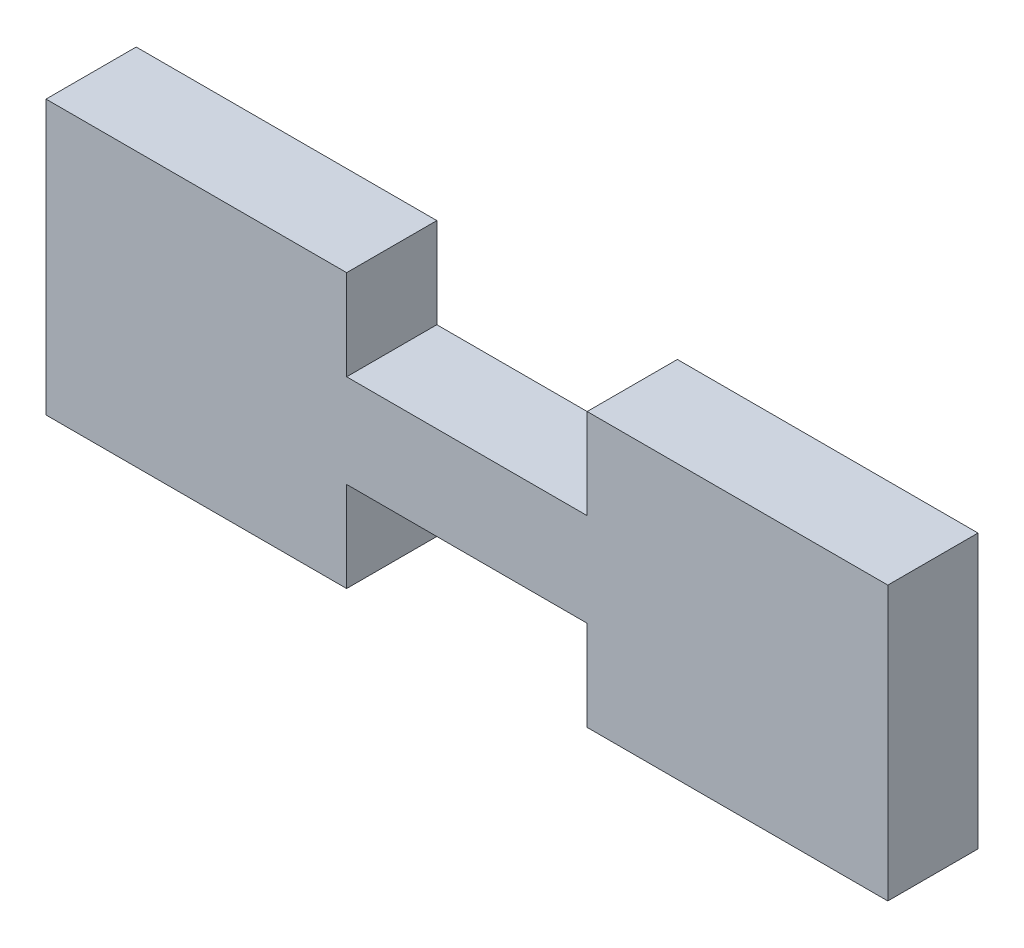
ISO-10303-21;
HEADER;
FILE_DESCRIPTION(('STEP AP214'),'2;1');
FILE_NAME('part.step','',(''),(''),'','','');
FILE_SCHEMA(('AUTOMOTIVE_DESIGN { 1 0 10303 214 1 1 1 1 }'));
ENDSEC;
DATA;
#1=APPLICATION_CONTEXT('core data for automotive mechanical design processes');
#2=APPLICATION_PROTOCOL_DEFINITION('international standard','automotive_design',2000,#1);
#3=PRODUCT_CONTEXT('',#1,'mechanical');
#4=PRODUCT('Part','Part','',(#3));
#5=PRODUCT_RELATED_PRODUCT_CATEGORY('part','',(#4));
#6=PRODUCT_DEFINITION_FORMATION('','',#4);
#7=PRODUCT_DEFINITION_CONTEXT('part definition',#1,'design');
#8=PRODUCT_DEFINITION('design','',#6,#7);
#9=PRODUCT_DEFINITION_SHAPE('','',#8);
#10=(LENGTH_UNIT() NAMED_UNIT(*) SI_UNIT(.MILLI.,.METRE.));
#11=(NAMED_UNIT(*) PLANE_ANGLE_UNIT() SI_UNIT($,.RADIAN.));
#12=(NAMED_UNIT(*) SI_UNIT($,.STERADIAN.) SOLID_ANGLE_UNIT());
#13=UNCERTAINTY_MEASURE_WITH_UNIT(LENGTH_MEASURE(1.E-05),#10,'distance_accuracy_value','');
#14=(GEOMETRIC_REPRESENTATION_CONTEXT(3) GLOBAL_UNCERTAINTY_ASSIGNED_CONTEXT((#13)) GLOBAL_UNIT_ASSIGNED_CONTEXT((#10,
#11,#12)) REPRESENTATION_CONTEXT('',''));
#15=CARTESIAN_POINT('',(0.,0.,0.));
#16=DIRECTION('',(0.,0.,1.));
#17=DIRECTION('',(1.,0.,0.));
#18=AXIS2_PLACEMENT_3D('',#15,#16,#17);
#19=CARTESIAN_POINT('',(22.3846510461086,-3.,3.));
#20=DIRECTION('',(0.,1.,0.));
#21=DIRECTION('',(0.,0.,1.));
#22=AXIS2_PLACEMENT_3D('',#19,#20,#21);
#23=PLANE('',#22);
#24=DIRECTION('',(1.,0.,0.));
#25=VECTOR('',#24,1.);
#26=CARTESIAN_POINT('',(22.3846510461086,-3.,0.));
#27=LINE('',#26,#25);
#28=CARTESIAN_POINT('',(12.3846510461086,-3.,0.));
#29=VERTEX_POINT('',#28);
#30=CARTESIAN_POINT('',(22.3846510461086,-3.,0.));
#31=VERTEX_POINT('',#30);
#32=EDGE_CURVE('E153',#29,#31,#27,.T.);
#33=ORIENTED_EDGE('',*,*,#32,.T.);
#34=DIRECTION('',(0.,0.,-1.));
#35=VECTOR('',#34,1.);
#36=CARTESIAN_POINT('',(22.3846510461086,-3.,3.));
#37=LINE('',#36,#35);
#38=CARTESIAN_POINT('',(22.3846510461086,-3.,3.));
#39=VERTEX_POINT('',#38);
#40=EDGE_CURVE('E11',#39,#31,#37,.T.);
#41=ORIENTED_EDGE('',*,*,#40,.F.);
#42=DIRECTION('',(1.,0.,0.));
#43=VECTOR('',#42,1.);
#44=CARTESIAN_POINT('',(22.3846510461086,-3.,3.));
#45=LINE('',#44,#43);
#46=CARTESIAN_POINT('',(12.3846510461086,-3.,3.));
#47=VERTEX_POINT('',#46);
#48=EDGE_CURVE('E175',#47,#39,#45,.T.);
#49=ORIENTED_EDGE('',*,*,#48,.F.);
#50=DIRECTION('',(0.,0.,-1.));
#51=VECTOR('',#50,1.);
#52=CARTESIAN_POINT('',(12.3846510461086,-3.,3.));
#53=LINE('',#52,#51);
#54=EDGE_CURVE('E149',#47,#29,#53,.T.);
#55=ORIENTED_EDGE('',*,*,#54,.T.);
#56=EDGE_LOOP('',(#33,#41,#49,#55));
#57=FACE_BOUND('',#56,.T.);
#58=ADVANCED_FACE('F33',(#57),#23,.F.);
#59=CARTESIAN_POINT('',(22.3846510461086,0.,3.));
#60=DIRECTION('',(-1.,0.,0.));
#61=DIRECTION('',(0.,0.,1.));
#62=AXIS2_PLACEMENT_3D('',#59,#60,#61);
#63=PLANE('',#62);
#64=DIRECTION('',(0.,1.,0.));
#65=VECTOR('',#64,1.);
#66=CARTESIAN_POINT('',(22.3846510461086,0.,0.));
#67=LINE('',#66,#65);
#68=CARTESIAN_POINT('',(22.3846510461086,0.,0.));
#69=VERTEX_POINT('',#68);
#70=EDGE_CURVE('E156',#31,#69,#67,.T.);
#71=ORIENTED_EDGE('',*,*,#70,.T.);
#72=DIRECTION('',(0.,0.,-1.));
#73=VECTOR('',#72,1.);
#74=CARTESIAN_POINT('',(22.3846510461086,0.,3.));
#75=LINE('',#74,#73);
#76=CARTESIAN_POINT('',(22.3846510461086,0.,3.));
#77=VERTEX_POINT('',#76);
#78=EDGE_CURVE('E41',#77,#69,#75,.T.);
#79=ORIENTED_EDGE('',*,*,#78,.F.);
#80=DIRECTION('',(0.,1.,0.));
#81=VECTOR('',#80,1.);
#82=CARTESIAN_POINT('',(22.3846510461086,0.,3.));
#83=LINE('',#82,#81);
#84=EDGE_CURVE('E104',#39,#77,#83,.T.);
#85=ORIENTED_EDGE('',*,*,#84,.F.);
#86=ORIENTED_EDGE('',*,*,#40,.T.);
#87=EDGE_LOOP('',(#71,#79,#85,#86));
#88=FACE_BOUND('',#87,.T.);
#89=ADVANCED_FACE('F253',(#88),#63,.F.);
#90=CARTESIAN_POINT('',(30.3846510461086,0.,3.));
#91=DIRECTION('',(0.,1.,0.));
#92=DIRECTION('',(0.,0.,1.));
#93=AXIS2_PLACEMENT_3D('',#90,#91,#92);
#94=PLANE('',#93);
#95=DIRECTION('',(1.,0.,0.));
#96=VECTOR('',#95,1.);
#97=CARTESIAN_POINT('',(30.3846510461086,0.,0.));
#98=LINE('',#97,#96);
#99=CARTESIAN_POINT('',(30.3846510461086,0.,0.));
#100=VERTEX_POINT('',#99);
#101=EDGE_CURVE('E158',#69,#100,#98,.T.);
#102=ORIENTED_EDGE('',*,*,#101,.T.);
#103=DIRECTION('',(0.,0.,-1.));
#104=VECTOR('',#103,1.);
#105=CARTESIAN_POINT('',(30.3846510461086,0.,3.));
#106=LINE('',#105,#104);
#107=CARTESIAN_POINT('',(30.3846510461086,0.,3.));
#108=VERTEX_POINT('',#107);
#109=EDGE_CURVE('E194',#108,#100,#106,.T.);
#110=ORIENTED_EDGE('',*,*,#109,.F.);
#111=DIRECTION('',(1.,0.,0.));
#112=VECTOR('',#111,1.);
#113=CARTESIAN_POINT('',(30.3846510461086,0.,3.));
#114=LINE('',#113,#112);
#115=EDGE_CURVE('E202',#77,#108,#114,.T.);
#116=ORIENTED_EDGE('',*,*,#115,.F.);
#117=ORIENTED_EDGE('',*,*,#78,.T.);
#118=EDGE_LOOP('',(#102,#110,#116,#117));
#119=FACE_BOUND('',#118,.T.);
#120=ADVANCED_FACE('F200',(#119),#94,.F.);
#121=CARTESIAN_POINT('',(30.3846510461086,-3.,3.));
#122=DIRECTION('',(1.,0.,0.));
#123=DIRECTION('',(0.,0.,-1.));
#124=AXIS2_PLACEMENT_3D('',#121,#122,#123);
#125=PLANE('',#124);
#126=DIRECTION('',(0.,-1.,0.));
#127=VECTOR('',#126,1.);
#128=CARTESIAN_POINT('',(30.3846510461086,-3.,0.));
#129=LINE('',#128,#127);
#130=CARTESIAN_POINT('',(30.3846510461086,-3.,0.));
#131=VERTEX_POINT('',#130);
#132=EDGE_CURVE('E160',#100,#131,#129,.T.);
#133=ORIENTED_EDGE('',*,*,#132,.T.);
#134=DIRECTION('',(0.,0.,-1.));
#135=VECTOR('',#134,1.);
#136=CARTESIAN_POINT('',(30.3846510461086,-3.,3.));
#137=LINE('',#136,#135);
#138=CARTESIAN_POINT('',(30.3846510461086,-3.,3.));
#139=VERTEX_POINT('',#138);
#140=EDGE_CURVE('E191',#139,#131,#137,.T.);
#141=ORIENTED_EDGE('',*,*,#140,.F.);
#142=DIRECTION('',(0.,-1.,0.));
#143=VECTOR('',#142,1.);
#144=CARTESIAN_POINT('',(30.3846510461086,-3.,3.));
#145=LINE('',#144,#143);
#146=EDGE_CURVE('E220',#108,#139,#145,.T.);
#147=ORIENTED_EDGE('',*,*,#146,.F.);
#148=ORIENTED_EDGE('',*,*,#109,.T.);
#149=EDGE_LOOP('',(#133,#141,#147,#148));
#150=FACE_BOUND('',#149,.T.);
#151=ADVANCED_FACE('F211',(#150),#125,.F.);
#152=CARTESIAN_POINT('',(40.3846510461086,-3.,3.));
#153=DIRECTION('',(0.,1.,0.));
#154=DIRECTION('',(0.,0.,1.));
#155=AXIS2_PLACEMENT_3D('',#152,#153,#154);
#156=PLANE('',#155);
#157=DIRECTION('',(1.,0.,0.));
#158=VECTOR('',#157,1.);
#159=CARTESIAN_POINT('',(40.3846510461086,-3.,0.));
#160=LINE('',#159,#158);
#161=CARTESIAN_POINT('',(40.3846510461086,-3.,0.));
#162=VERTEX_POINT('',#161);
#163=EDGE_CURVE('E162',#131,#162,#160,.T.);
#164=ORIENTED_EDGE('',*,*,#163,.T.);
#165=DIRECTION('',(0.,0.,-1.));
#166=VECTOR('',#165,1.);
#167=CARTESIAN_POINT('',(40.3846510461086,-3.,3.));
#168=LINE('',#167,#166);
#169=CARTESIAN_POINT('',(40.3846510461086,-3.,3.));
#170=VERTEX_POINT('',#169);
#171=EDGE_CURVE('E188',#170,#162,#168,.T.);
#172=ORIENTED_EDGE('',*,*,#171,.F.);
#173=DIRECTION('',(1.,0.,0.));
#174=VECTOR('',#173,1.);
#175=CARTESIAN_POINT('',(40.3846510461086,-3.,3.));
#176=LINE('',#175,#174);
#177=EDGE_CURVE('E217',#139,#170,#176,.T.);
#178=ORIENTED_EDGE('',*,*,#177,.F.);
#179=ORIENTED_EDGE('',*,*,#140,.T.);
#180=EDGE_LOOP('',(#164,#172,#178,#179));
#181=FACE_BOUND('',#180,.T.);
#182=ADVANCED_FACE('F215',(#181),#156,.F.);
#183=CARTESIAN_POINT('',(40.3846510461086,6.09999999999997,3.));
#184=DIRECTION('',(-1.,0.,0.));
#185=DIRECTION('',(0.,-1.,0.));
#186=AXIS2_PLACEMENT_3D('',#183,#184,#185);
#187=PLANE('',#186);
#188=DIRECTION('',(0.,1.,0.));
#189=VECTOR('',#188,1.);
#190=CARTESIAN_POINT('',(40.3846510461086,6.09999999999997,0.));
#191=LINE('',#190,#189);
#192=CARTESIAN_POINT('',(40.3846510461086,6.09999999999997,0.));
#193=VERTEX_POINT('',#192);
#194=EDGE_CURVE('E164',#162,#193,#191,.T.);
#195=ORIENTED_EDGE('',*,*,#194,.T.);
#196=DIRECTION('',(0.,0.,-1.));
#197=VECTOR('',#196,1.);
#198=CARTESIAN_POINT('',(40.3846510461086,6.09999999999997,3.));
#199=LINE('',#198,#197);
#200=CARTESIAN_POINT('',(40.3846510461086,6.09999999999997,3.));
#201=VERTEX_POINT('',#200);
#202=EDGE_CURVE('E185',#201,#193,#199,.T.);
#203=ORIENTED_EDGE('',*,*,#202,.F.);
#204=DIRECTION('',(0.,1.,0.));
#205=VECTOR('',#204,1.);
#206=CARTESIAN_POINT('',(40.3846510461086,6.09999999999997,3.));
#207=LINE('',#206,#205);
#208=EDGE_CURVE('E219',#170,#201,#207,.T.);
#209=ORIENTED_EDGE('',*,*,#208,.F.);
#210=ORIENTED_EDGE('',*,*,#171,.T.);
#211=EDGE_LOOP('',(#195,#203,#209,#210));
#212=FACE_BOUND('',#211,.T.);
#213=ADVANCED_FACE('F266',(#212),#187,.F.);
#214=CARTESIAN_POINT('',(30.3846510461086,6.09999999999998,3.));
#215=DIRECTION('',(0.,-1.,0.));
#216=DIRECTION('',(1.,0.,0.));
#217=AXIS2_PLACEMENT_3D('',#214,#215,#216);
#218=PLANE('',#217);
#219=DIRECTION('',(-1.,0.,0.));
#220=VECTOR('',#219,1.);
#221=CARTESIAN_POINT('',(30.3846510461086,6.09999999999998,0.));
#222=LINE('',#221,#220);
#223=CARTESIAN_POINT('',(30.3846510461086,6.09999999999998,0.));
#224=VERTEX_POINT('',#223);
#225=EDGE_CURVE('E166',#193,#224,#222,.T.);
#226=ORIENTED_EDGE('',*,*,#225,.T.);
#227=DIRECTION('',(0.,0.,-1.));
#228=VECTOR('',#227,1.);
#229=CARTESIAN_POINT('',(30.3846510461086,6.09999999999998,3.));
#230=LINE('',#229,#228);
#231=CARTESIAN_POINT('',(30.3846510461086,6.09999999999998,3.));
#232=VERTEX_POINT('',#231);
#233=EDGE_CURVE('E182',#232,#224,#230,.T.);
#234=ORIENTED_EDGE('',*,*,#233,.F.);
#235=DIRECTION('',(-1.,0.,0.));
#236=VECTOR('',#235,1.);
#237=CARTESIAN_POINT('',(30.3846510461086,6.09999999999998,3.));
#238=LINE('',#237,#236);
#239=EDGE_CURVE('E222',#201,#232,#238,.T.);
#240=ORIENTED_EDGE('',*,*,#239,.F.);
#241=ORIENTED_EDGE('',*,*,#202,.T.);
#242=EDGE_LOOP('',(#226,#234,#240,#241));
#243=FACE_BOUND('',#242,.T.);
#244=ADVANCED_FACE('F269',(#243),#218,.F.);
#245=CARTESIAN_POINT('',(30.3846510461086,3.09999999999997,3.));
#246=DIRECTION('',(1.,0.,0.));
#247=DIRECTION('',(0.,0.,-1.));
#248=AXIS2_PLACEMENT_3D('',#245,#246,#247);
#249=PLANE('',#248);
#250=DIRECTION('',(0.,-1.,0.));
#251=VECTOR('',#250,1.);
#252=CARTESIAN_POINT('',(30.3846510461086,3.09999999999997,0.));
#253=LINE('',#252,#251);
#254=CARTESIAN_POINT('',(30.3846510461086,3.09999999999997,0.));
#255=VERTEX_POINT('',#254);
#256=EDGE_CURVE('E168',#224,#255,#253,.T.);
#257=ORIENTED_EDGE('',*,*,#256,.T.);
#258=DIRECTION('',(0.,0.,-1.));
#259=VECTOR('',#258,1.);
#260=CARTESIAN_POINT('',(30.3846510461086,3.09999999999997,3.));
#261=LINE('',#260,#259);
#262=CARTESIAN_POINT('',(30.3846510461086,3.09999999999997,3.));
#263=VERTEX_POINT('',#262);
#264=EDGE_CURVE('E179',#263,#255,#261,.T.);
#265=ORIENTED_EDGE('',*,*,#264,.F.);
#266=DIRECTION('',(0.,-1.,0.));
#267=VECTOR('',#266,1.);
#268=CARTESIAN_POINT('',(30.3846510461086,3.09999999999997,3.));
#269=LINE('',#268,#267);
#270=EDGE_CURVE('E228',#232,#263,#269,.T.);
#271=ORIENTED_EDGE('',*,*,#270,.F.);
#272=ORIENTED_EDGE('',*,*,#233,.T.);
#273=EDGE_LOOP('',(#257,#265,#271,#272));
#274=FACE_BOUND('',#273,.T.);
#275=ADVANCED_FACE('F234',(#274),#249,.F.);
#276=CARTESIAN_POINT('',(22.3846510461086,3.09999999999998,3.));
#277=DIRECTION('',(0.,-1.,0.));
#278=DIRECTION('',(1.,0.,0.));
#279=AXIS2_PLACEMENT_3D('',#276,#277,#278);
#280=PLANE('',#279);
#281=DIRECTION('',(-1.,0.,0.));
#282=VECTOR('',#281,1.);
#283=CARTESIAN_POINT('',(22.3846510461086,3.09999999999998,0.));
#284=LINE('',#283,#282);
#285=CARTESIAN_POINT('',(22.3846510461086,3.09999999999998,0.));
#286=VERTEX_POINT('',#285);
#287=EDGE_CURVE('E170',#255,#286,#284,.T.);
#288=ORIENTED_EDGE('',*,*,#287,.T.);
#289=DIRECTION('',(0.,0.,-1.));
#290=VECTOR('',#289,1.);
#291=CARTESIAN_POINT('',(22.3846510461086,3.09999999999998,3.));
#292=LINE('',#291,#290);
#293=CARTESIAN_POINT('',(22.3846510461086,3.09999999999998,3.));
#294=VERTEX_POINT('',#293);
#295=EDGE_CURVE('E144',#294,#286,#292,.T.);
#296=ORIENTED_EDGE('',*,*,#295,.F.);
#297=DIRECTION('',(-1.,0.,0.));
#298=VECTOR('',#297,1.);
#299=CARTESIAN_POINT('',(22.3846510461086,3.09999999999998,3.));
#300=LINE('',#299,#298);
#301=EDGE_CURVE('E135',#263,#294,#300,.T.);
#302=ORIENTED_EDGE('',*,*,#301,.F.);
#303=ORIENTED_EDGE('',*,*,#264,.T.);
#304=EDGE_LOOP('',(#288,#296,#302,#303));
#305=FACE_BOUND('',#304,.T.);
#306=ADVANCED_FACE('F238',(#305),#280,.F.);
#307=CARTESIAN_POINT('',(22.3846510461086,6.09999999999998,3.));
#308=DIRECTION('',(-1.,0.,0.));
#309=DIRECTION('',(0.,0.,1.));
#310=AXIS2_PLACEMENT_3D('',#307,#308,#309);
#311=PLANE('',#310);
#312=DIRECTION('',(0.,1.,0.));
#313=VECTOR('',#312,1.);
#314=CARTESIAN_POINT('',(22.3846510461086,6.09999999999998,0.));
#315=LINE('',#314,#313);
#316=CARTESIAN_POINT('',(22.3846510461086,6.09999999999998,0.));
#317=VERTEX_POINT('',#316);
#318=EDGE_CURVE('E143',#286,#317,#315,.T.);
#319=ORIENTED_EDGE('',*,*,#318,.T.);
#320=DIRECTION('',(0.,0.,-1.));
#321=VECTOR('',#320,1.);
#322=CARTESIAN_POINT('',(22.3846510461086,6.09999999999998,3.));
#323=LINE('',#322,#321);
#324=CARTESIAN_POINT('',(22.3846510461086,6.09999999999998,3.));
#325=VERTEX_POINT('',#324);
#326=EDGE_CURVE('E140',#325,#317,#323,.T.);
#327=ORIENTED_EDGE('',*,*,#326,.F.);
#328=DIRECTION('',(0.,1.,0.));
#329=VECTOR('',#328,1.);
#330=CARTESIAN_POINT('',(22.3846510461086,6.09999999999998,3.));
#331=LINE('',#330,#329);
#332=EDGE_CURVE('E129',#294,#325,#331,.T.);
#333=ORIENTED_EDGE('',*,*,#332,.F.);
#334=ORIENTED_EDGE('',*,*,#295,.T.);
#335=EDGE_LOOP('',(#319,#327,#333,#334));
#336=FACE_BOUND('',#335,.T.);
#337=ADVANCED_FACE('F141',(#336),#311,.F.);
#338=CARTESIAN_POINT('',(12.3846510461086,6.09999999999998,3.));
#339=DIRECTION('',(0.,-1.,0.));
#340=DIRECTION('',(1.,0.,0.));
#341=AXIS2_PLACEMENT_3D('',#338,#339,#340);
#342=PLANE('',#341);
#343=DIRECTION('',(-1.,0.,0.));
#344=VECTOR('',#343,1.);
#345=CARTESIAN_POINT('',(12.3846510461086,6.09999999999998,0.));
#346=LINE('',#345,#344);
#347=CARTESIAN_POINT('',(12.3846510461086,6.09999999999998,0.));
#348=VERTEX_POINT('',#347);
#349=EDGE_CURVE('E90',#317,#348,#346,.T.);
#350=ORIENTED_EDGE('',*,*,#349,.T.);
#351=DIRECTION('',(0.,0.,-1.));
#352=VECTOR('',#351,1.);
#353=CARTESIAN_POINT('',(12.3846510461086,6.09999999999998,3.));
#354=LINE('',#353,#352);
#355=CARTESIAN_POINT('',(12.3846510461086,6.09999999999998,3.));
#356=VERTEX_POINT('',#355);
#357=EDGE_CURVE('E145',#356,#348,#354,.T.);
#358=ORIENTED_EDGE('',*,*,#357,.F.);
#359=DIRECTION('',(-1.,0.,0.));
#360=VECTOR('',#359,1.);
#361=CARTESIAN_POINT('',(12.3846510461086,6.09999999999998,3.));
#362=LINE('',#361,#360);
#363=EDGE_CURVE('E133',#325,#356,#362,.T.);
#364=ORIENTED_EDGE('',*,*,#363,.F.);
#365=ORIENTED_EDGE('',*,*,#326,.T.);
#366=EDGE_LOOP('',(#350,#358,#364,#365));
#367=FACE_BOUND('',#366,.T.);
#368=ADVANCED_FACE('F147',(#367),#342,.F.);
#369=CARTESIAN_POINT('',(12.3846510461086,-3.,3.));
#370=DIRECTION('',(1.,0.,0.));
#371=DIRECTION('',(0.,1.,0.));
#372=AXIS2_PLACEMENT_3D('',#369,#370,#371);
#373=PLANE('',#372);
#374=DIRECTION('',(0.,-1.,0.));
#375=VECTOR('',#374,1.);
#376=CARTESIAN_POINT('',(12.3846510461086,-3.,0.));
#377=LINE('',#376,#375);
#378=EDGE_CURVE('E96',#348,#29,#377,.T.);
#379=ORIENTED_EDGE('',*,*,#378,.T.);
#380=ORIENTED_EDGE('',*,*,#54,.F.);
#381=DIRECTION('',(0.,-1.,0.));
#382=VECTOR('',#381,1.);
#383=CARTESIAN_POINT('',(12.3846510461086,-3.,3.));
#384=LINE('',#383,#382);
#385=EDGE_CURVE('E49',#356,#47,#384,.T.);
#386=ORIENTED_EDGE('',*,*,#385,.F.);
#387=ORIENTED_EDGE('',*,*,#357,.T.);
#388=EDGE_LOOP('',(#379,#380,#386,#387));
#389=FACE_BOUND('',#388,.T.);
#390=ADVANCED_FACE('F242',(#389),#373,.F.);
#391=CARTESIAN_POINT('',(0.,0.,3.));
#392=DIRECTION('',(0.,0.,-1.));
#393=DIRECTION('',(-1.,0.,0.));
#394=AXIS2_PLACEMENT_3D('',#391,#392,#393);
#395=PLANE('',#394);
#396=ORIENTED_EDGE('',*,*,#48,.T.);
#397=ORIENTED_EDGE('',*,*,#84,.T.);
#398=ORIENTED_EDGE('',*,*,#115,.T.);
#399=ORIENTED_EDGE('',*,*,#146,.T.);
#400=ORIENTED_EDGE('',*,*,#177,.T.);
#401=ORIENTED_EDGE('',*,*,#208,.T.);
#402=ORIENTED_EDGE('',*,*,#239,.T.);
#403=ORIENTED_EDGE('',*,*,#270,.T.);
#404=ORIENTED_EDGE('',*,*,#301,.T.);
#405=ORIENTED_EDGE('',*,*,#332,.T.);
#406=ORIENTED_EDGE('',*,*,#363,.T.);
#407=ORIENTED_EDGE('',*,*,#385,.T.);
#408=EDGE_LOOP('',(#396,#397,#398,#399,#400,#401,#402,#403,#404,#405,#406,#407));
#409=FACE_BOUND('',#408,.T.);
#410=ADVANCED_FACE('F131',(#409),#395,.F.);
#411=CARTESIAN_POINT('',(0.,0.,0.));
#412=DIRECTION('',(0.,0.,-1.));
#413=DIRECTION('',(-1.,0.,0.));
#414=AXIS2_PLACEMENT_3D('',#411,#412,#413);
#415=PLANE('',#414);
#416=ORIENTED_EDGE('',*,*,#32,.F.);
#417=ORIENTED_EDGE('',*,*,#378,.F.);
#418=ORIENTED_EDGE('',*,*,#349,.F.);
#419=ORIENTED_EDGE('',*,*,#318,.F.);
#420=ORIENTED_EDGE('',*,*,#287,.F.);
#421=ORIENTED_EDGE('',*,*,#256,.F.);
#422=ORIENTED_EDGE('',*,*,#225,.F.);
#423=ORIENTED_EDGE('',*,*,#194,.F.);
#424=ORIENTED_EDGE('',*,*,#163,.F.);
#425=ORIENTED_EDGE('',*,*,#132,.F.);
#426=ORIENTED_EDGE('',*,*,#101,.F.);
#427=ORIENTED_EDGE('',*,*,#70,.F.);
#428=EDGE_LOOP('',(#416,#417,#418,#419,#420,#421,#422,#423,#424,#425,#426,#427));
#429=FACE_BOUND('',#428,.T.);
#430=ADVANCED_FACE('F206',(#429),#415,.T.);
#431=CLOSED_SHELL('',(#58,#89,#120,#151,#182,#213,#244,#275,#306,#337,#368,#390,#410,#430));
#432=MANIFOLD_SOLID_BREP('B2',#431);
#433=ADVANCED_BREP_SHAPE_REPRESENTATION('',(#18,#432),#14);
#434=SHAPE_DEFINITION_REPRESENTATION(#9,#433);
ENDSEC;
END-ISO-10303-21;
